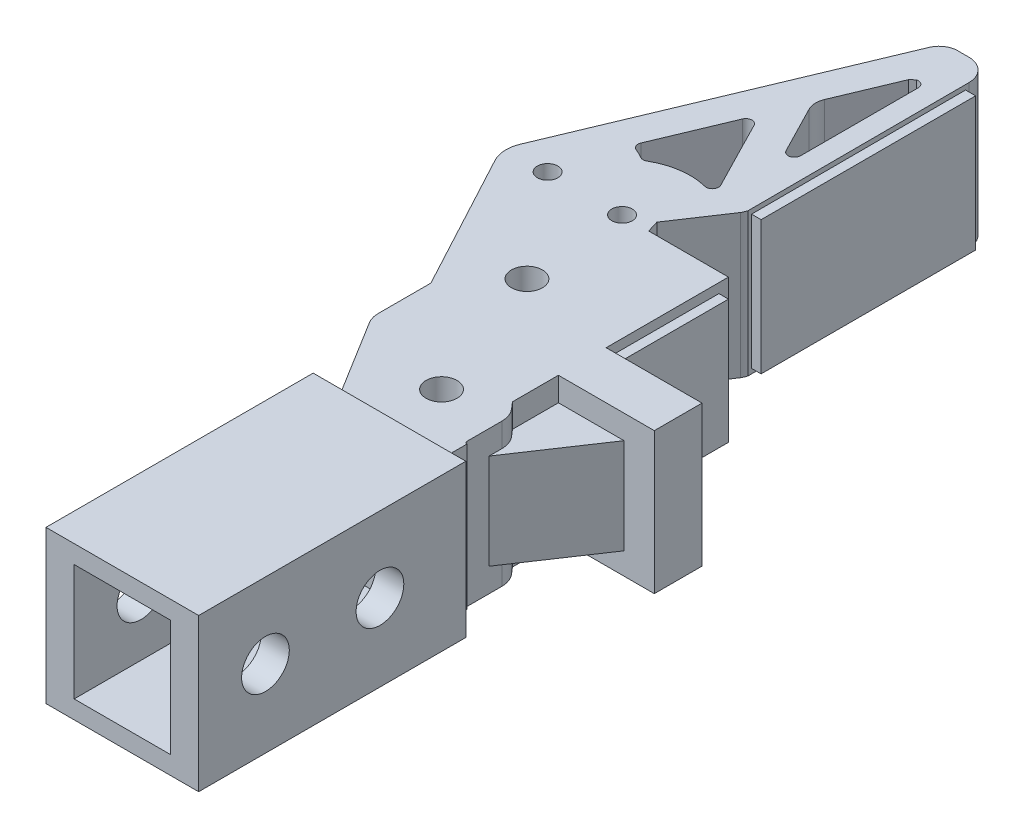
from build123d import *

# Parameters (mm, degrees)
CROQUIS1_R              = 1.072500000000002
CROQUIS1_R_2            = 1.072499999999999
CROQUIS1_R_3            = 1.625000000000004
SALIENTE_EXTRUIR1_DEPTH = 7.5
BOSS_EXTRUDE1_DEPTH     = 15
BOSS_EXTRUDE2_DEPTH     = 28
BOSS_EXTRUDE3_DEPTH     = 4
SKETCH8_R               = 2.4999999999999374
SKETCH8_R_2             = 2.499999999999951
CUT_EXTRUDE6_DEPTH      = 30
BOSS_EXTRUDE4_DEPTH     = 14
BOSS_EXTRUDE5_DEPTH     = 10.049999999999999
SKETCH13_W              = 10.822437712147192
SKETCH13_H              = 13.000000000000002
BOSS_EXTRUDE6_DEPTH     = 1
BOSS_EXTRUDE7_DEPTH     = 5
SKETCH9_W               = 10.099999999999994
SKETCH9_H               = 12.199999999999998
CUT_EXTRUDE7_DEPTH      = 25.5
BOSS_EXTRUDE8_DEPTH     = 5


with BuildPart() as part:
    # Croquis1 → Saliente-Extruir1 (new, symmetric)
    with BuildSketch(Plane(origin=(0, 0, 0), x_dir=(1, 0, 0), z_dir=(0, 1, 0))):
        with BuildLine():
            Line((10.218633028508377, -75.40154299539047), (9.272474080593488, -77.66409700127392))
            ThreePointArc((9.272474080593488, -77.66409700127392), (9.024633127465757, -79.07455445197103), (9.407079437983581, -80.45460886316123))
            Line((9.407079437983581, -80.45460886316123), (17.189236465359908, -94.95790934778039))
            Line((17.189236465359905, -94.95790934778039), (17.189236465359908, -100.46358218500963))
            ThreePointArc((17.189236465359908, -100.46358218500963), (17.284401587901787, -101.1467872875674), (17.562651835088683, -101.77797855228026))
            Line((17.562651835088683, -101.77797855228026), (22.520388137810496, -109.79918591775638))
            Line((22.520388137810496, -109.79918591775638), (33.68923646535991, -109.79918591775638))
            Line((33.68923646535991, -109.79918591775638), (33.68923646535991, -107.69694484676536))
            ThreePointArc((33.68923646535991, -107.69694484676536), (33.512462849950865, -107.62371985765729), (33.439241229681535, -107.44694484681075))
            Line((33.439241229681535, -107.44694484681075), (33.439241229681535, -103.77938695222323))
            ThreePointArc((33.439241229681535, -103.77938695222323), (33.28161851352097, -102.90573446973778), (32.82862630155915, -102.14224796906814))
            Line((32.82862630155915, -102.14224796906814), (27.544020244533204, -96.04340364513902))
            ThreePointArc((27.5440202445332, -96.04340364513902), (27.09102803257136, -95.27991714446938), (26.93340531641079, -94.40626466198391))
            Line((26.933405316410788, -94.40626466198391), (26.933405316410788, -90.94552886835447))
            Line((26.933405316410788, -90.94552886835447), (23.879016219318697, -78.82164973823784))
            Line((23.879016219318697, -78.82164973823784), (23.498144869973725, -77.5901811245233))
            Line((23.498144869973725, -77.5901811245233), (24.203297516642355, -76.53245215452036))
            Line((24.203297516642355, -76.53245215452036), (25.01427982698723, -75.31597868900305))
            Line((25.01427982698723, -75.31597868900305), (26.997460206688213, -72.34120811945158))
            ThreePointArc((26.997460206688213, -72.34120811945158), (27.1375383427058, -72.0671202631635), (27.238897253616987, -71.77647888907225))
            Line((27.238897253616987, -71.77647888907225), (27.187095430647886, -48.559281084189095))
            ThreePointArc((27.187095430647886, -48.559281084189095), (26.513672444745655, -46.938459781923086), (24.892939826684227, -46.2648233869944))
            Line((24.892939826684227, -46.2648233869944), (23.70584228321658, -46.262018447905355))
            ThreePointArc((23.70584228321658, -46.262018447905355), (22.626959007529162, -46.58496739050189), (21.90704334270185, -47.4509965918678))
            Line((21.90704334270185, -47.4509965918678), (10.63460647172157, -74.40682389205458))
            Line((10.63460647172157, -74.40682389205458), (10.218633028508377, -75.40154299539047))
        make_face()
        with Locations(Location((13.215984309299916, -78.75337148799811, 0), (0, 0, 270))):
            Circle(CROQUIS1_R, mode=Mode.SUBTRACT)
        with Locations(Location((21.015984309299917, -78.75337148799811, 0), (0, 0, 270))):
            Circle(CROQUIS1_R_2, mode=Mode.SUBTRACT)
        with Locations(Location((27.39268283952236, -104.04877330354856, 0), (0, 0, 270))):
            Circle(CROQUIS1_R_3, mode=Mode.SUBTRACT)
        with Locations(Location((21.84018236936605, -89.54232945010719, 0), (0, 0, 270))):
            Circle(CROQUIS1_R_3, mode=Mode.SUBTRACT)
        with BuildLine():
            Line((15.478789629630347, -71.24682770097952), (18.61946747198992, -63.73651112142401))
            ThreePointArc((18.61946747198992, -63.73651112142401), (18.793493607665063, -63.49604035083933), (19.056288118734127, -63.35801740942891))
            ThreePointArc((19.056288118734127, -63.35801740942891), (19.48504119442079, -63.3941587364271), (19.797280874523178, -63.69020227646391))
            Line((19.797280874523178, -63.69020227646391), (23.498144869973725, -70.89224924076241))
            ThreePointArc((23.498144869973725, -70.89224924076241), (23.546779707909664, -71.36154621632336), (23.265183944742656, -71.7401077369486))
            ThreePointArc((23.265183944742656, -71.7401077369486), (23.049467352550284, -71.82630960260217), (22.817215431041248, -71.83115261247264))
            ThreePointArc((22.817215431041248, -71.83115261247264), (22.78915153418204, -71.82602389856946), (22.761339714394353, -71.81966868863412))
            ThreePointArc((22.761339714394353, -71.81966868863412), (20.02886713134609, -71.67183919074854), (17.440984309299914, -72.56128985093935))
            ThreePointArc((17.440984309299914, -72.56128985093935), (17.284216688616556, -72.62622512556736), (17.115984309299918, -72.64837333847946))
            ThreePointArc((17.115984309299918, -72.64837333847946), (16.947751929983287, -72.62622512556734), (16.79098430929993, -72.56128985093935))
            ThreePointArc((16.79098430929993, -72.56128985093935), (16.32394187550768, -72.31418677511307), (15.839926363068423, -72.10224916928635))
            ThreePointArc((15.839926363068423, -72.10224916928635), (15.637163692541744, -71.97483515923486), (15.494300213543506, -71.78264500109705))
            ThreePointArc((15.494300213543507, -71.78264500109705), (15.428738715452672, -71.51640969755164), (15.478789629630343, -71.24682770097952))
        make_face(mode=Mode.SUBTRACT)
        with BuildLine():
            Line((23.779731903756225, -64.3294187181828), (21.21259459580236, -59.33365462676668))
            ThreePointArc((21.21259459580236, -59.33365462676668), (21.1493573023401, -59.19802918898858), (21.09670648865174, -59.05795382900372))
            ThreePointArc((21.09670648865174, -59.05795382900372), (20.998372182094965, -58.36937278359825), (21.147973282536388, -57.6900841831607))
            Line((21.147973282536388, -57.6900841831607), (23.758191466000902, -51.448258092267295))
            Line((23.758191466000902, -51.448258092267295), (24.195012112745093, -51.06976438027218))
            ThreePointArc((24.195012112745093, -51.06976438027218), (24.485755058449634, -51.06173701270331), (24.750891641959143, -51.18131331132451))
            ThreePointArc((24.750891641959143, -51.18131331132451), (24.9400904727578, -51.41003823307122), (25.007868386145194, -51.6990320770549))
            Line((25.007868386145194, -51.6990320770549), (25.007868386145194, -64.03233588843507))
            ThreePointArc((25.007868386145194, -64.03233588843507), (24.9400904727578, -64.32132973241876), (24.750891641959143, -64.55005465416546))
            ThreePointArc((24.750891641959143, -64.55005465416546), (24.213865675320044, -64.66618383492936), (23.779731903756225, -64.3294187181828))
        make_face(mode=Mode.SUBTRACT)
    extrude(amount=SALIENTE_EXTRUIR1_DEPTH, both=True)

    # Sketch4 → Boss-Extrude1 (add, through all)
    with BuildSketch(Plane(origin=(0, 7.5, 0), x_dir=(1, 0, 0), z_dir=(0, 1, 0))):
        with BuildLine():
            Line((32.2394319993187, -78.82164973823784), (23.879016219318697, -78.82164973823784))
            Line((23.879016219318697, -78.82164973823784), (26.933405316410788, -90.94552886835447))
            Line((26.933405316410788, -90.94552886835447), (26.933405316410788, -94.40626466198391))
            ThreePointArc((26.93340531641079, -94.40626466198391), (27.09102803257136, -95.27991714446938), (27.544020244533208, -96.04340364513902))
            Line((27.544020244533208, -96.04340364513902), (32.2394319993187, -101.46227215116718))
            Line((32.2394319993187, -101.46227215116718), (32.2394319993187, -78.82164973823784))
        make_face()
    extrude(amount=-BOSS_EXTRUDE1_DEPTH)

    # Sketch7 → Boss-Extrude2 (add)
    with BuildSketch(Plane.XY.offset(109.79918591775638)):
        Polygon((19.690388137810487, 8), (19.69038813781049, -8), (35.69038813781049, -8), (35.69038813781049, 8), align=None)
    extrude(amount=BOSS_EXTRUDE2_DEPTH)

    # Sketch10 → Boss-Extrude3 (add, symmetric)
    with BuildSketch(Plane.ZY.offset(-25.69038813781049)):
        Polygon((113.94713375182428, 7.999999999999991), (109.79918336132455, 7.499999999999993), (109.79918336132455, 7.999999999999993), align=None)
        Polygon((113.94713375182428, -7.999999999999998), (109.79918336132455, -7.5), (109.79918336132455, -8), align=None)
    extrude(amount=BOSS_EXTRUDE3_DEPTH, both=True)

    # Sketch8 → Cut-Extrude6 (cut)
    with BuildSketch(Plane.ZY.offset(-19.690388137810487)):
        with Locations(Location((130.79918591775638, 0.09999999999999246, 0), (0, 0, 270))):
            Circle(SKETCH8_R)
        with Locations(Location((118.79918591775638, 0.09999999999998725, 0), (0, 0, 270))):
            Circle(SKETCH8_R_2)
    extrude(amount=-CUT_EXTRUDE6_DEPTH, mode=Mode.SUBTRACT)

    # Sketch11 → Boss-Extrude4 (add)
    with BuildSketch(Plane(origin=(0, -6.999999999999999, 0), x_dir=(-1, 0, 0), z_dir=(0, -1, 0))):
        Polygon((-27.18789789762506, -48.918940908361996), (-27.238058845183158, -71.40071036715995), (-28.23805884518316, -71.40071036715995), (-28.238058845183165, -48.918940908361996), align=None)
    extrude(amount=-BOSS_EXTRUDE4_DEPTH)

    # Sketch12 → Boss-Extrude5 (add)
    with BuildSketch(Plane(origin=(32.2394319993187, 0, 0), x_dir=(-2.9e-16, 0, -1), z_dir=(1, 0, -2.9e-16))):
        Polygon((-96.64408745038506, -7.300000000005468), (-91.64408745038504, -7.3000000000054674), (-91.64408745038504, 7.5), (-96.64408745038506, 7.5), align=None)
    extrude(amount=BOSS_EXTRUDE5_DEPTH)

    # Sketch13 → Boss-Extrude6 (add)
    with BuildSketch(Plane(origin=(32.2394319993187, 0, 0), x_dir=(-3e-16, 0, -1), z_dir=(1, 0, -3e-16))):
        with Locations((-85.23286859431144, 0)):
            Rectangle(SKETCH13_W, SKETCH13_H)
    extrude(amount=BOSS_EXTRUDE6_DEPTH)

    # Sketch14 → Boss-Extrude7 (add, symmetric)
    with BuildSketch(Plane(origin=(0, 0, 0), x_dir=(1, 0, 0), z_dir=(0, 1, 0))):
        Polygon((19.690388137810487, -109.79918591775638), (20.29249482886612, -106.19463877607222), (22.52038813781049, -109.79918591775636), align=None)
    extrude(amount=BOSS_EXTRUDE7_DEPTH, both=True)

    # Sketch9 → Cut-Extrude7 (cut)
    with BuildSketch(Plane.XY.offset(137.79918591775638)):
        with Locations((27.690388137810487, 0)):
            Rectangle(SKETCH9_W, SKETCH9_H)
    extrude(amount=-CUT_EXTRUDE7_DEPTH, mode=Mode.SUBTRACT)

    # Sketch15 → Boss-Extrude8 (add, symmetric)
    with BuildSketch(Plane(origin=(0, 0, 0), x_dir=(1, 0, 0), z_dir=(0, 1, 0))):
        with BuildLine():
            Line((33.439241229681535, -105.11210221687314), (39.110631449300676, -96.64408745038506))
            Line((39.110631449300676, -96.64408745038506), (32.239431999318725, -96.64408745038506))
            Line((32.239431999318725, -96.64408745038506), (32.23943199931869, -101.46227215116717))
            Line((32.23943199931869, -101.46227215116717), (32.82862630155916, -102.14224796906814))
            ThreePointArc((32.82862630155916, -102.14224796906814), (33.28161851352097, -102.90573446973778), (33.439241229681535, -103.77938695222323))
            Line((33.439241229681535, -103.77938695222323), (33.439241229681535, -105.11210221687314))
        make_face()
    extrude(amount=BOSS_EXTRUDE8_DEPTH, both=True)


solid = part.part
